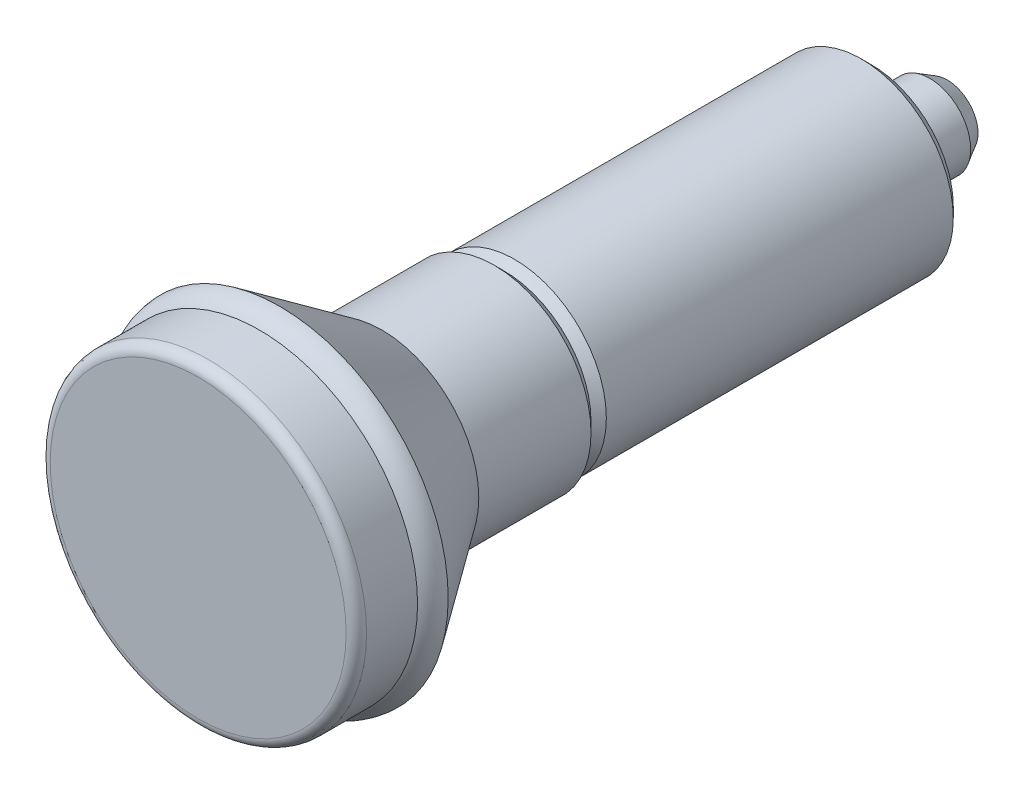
ISO-10303-21;
HEADER;
FILE_DESCRIPTION(('STEP AP214'),'2;1');
FILE_NAME('part.step','',(''),(''),'','','');
FILE_SCHEMA(('AUTOMOTIVE_DESIGN { 1 0 10303 214 1 1 1 1 }'));
ENDSEC;
DATA;
#1=APPLICATION_CONTEXT('core data for automotive mechanical design processes');
#2=APPLICATION_PROTOCOL_DEFINITION('international standard','automotive_design',2000,#1);
#3=PRODUCT_CONTEXT('',#1,'mechanical');
#4=PRODUCT('Part','Part','',(#3));
#5=PRODUCT_RELATED_PRODUCT_CATEGORY('part','',(#4));
#6=PRODUCT_DEFINITION_FORMATION('','',#4);
#7=PRODUCT_DEFINITION_CONTEXT('part definition',#1,'design');
#8=PRODUCT_DEFINITION('design','',#6,#7);
#9=PRODUCT_DEFINITION_SHAPE('','',#8);
#10=(LENGTH_UNIT() NAMED_UNIT(*) SI_UNIT(.MILLI.,.METRE.));
#11=(NAMED_UNIT(*) PLANE_ANGLE_UNIT() SI_UNIT($,.RADIAN.));
#12=(NAMED_UNIT(*) SI_UNIT($,.STERADIAN.) SOLID_ANGLE_UNIT());
#13=UNCERTAINTY_MEASURE_WITH_UNIT(LENGTH_MEASURE(1.E-05),#10,'distance_accuracy_value','');
#14=(GEOMETRIC_REPRESENTATION_CONTEXT(3) GLOBAL_UNCERTAINTY_ASSIGNED_CONTEXT((#13)) GLOBAL_UNIT_ASSIGNED_CONTEXT((#10,
#11,#12)) REPRESENTATION_CONTEXT('',''));
#15=CARTESIAN_POINT('',(0.,0.,0.));
#16=DIRECTION('',(0.,0.,1.));
#17=DIRECTION('',(1.,0.,0.));
#18=AXIS2_PLACEMENT_3D('',#15,#16,#17);
#19=CARTESIAN_POINT('',(0.,0.,1.25141216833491E-10));
#20=DIRECTION('',(0.,0.,1.));
#21=DIRECTION('',(0.,1.,0.));
#22=AXIS2_PLACEMENT_3D('',#19,#20,#21);
#23=SPHERICAL_SURFACE('',#22,8.);
#24=CARTESIAN_POINT('',(0.,0.,-7.4113534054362));
#25=DIRECTION('',(0.,0.,1.));
#26=DIRECTION('',(1.,0.,0.));
#27=AXIS2_PLACEMENT_3D('',#24,#25,#26);
#28=CIRCLE('',#27,3.01194965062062);
#29=CARTESIAN_POINT('',(3.01194965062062,0.,-7.4113534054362));
#30=VERTEX_POINT('',#29);
#31=EDGE_CURVE('E58',#30,#30,#28,.T.);
#32=ORIENTED_EDGE('',*,*,#31,.F.);
#33=EDGE_LOOP('',(#32));
#34=FACE_BOUND('',#33,.T.);
#35=ADVANCED_FACE('F12',(#34),#23,.T.);
#36=CARTESIAN_POINT('',(0.,14.5,66.));
#37=DIRECTION('',(0.,0.,1.));
#38=DIRECTION('',(1.,0.,0.));
#39=AXIS2_PLACEMENT_3D('',#36,#37,#38);
#40=PLANE('',#39);
#41=CARTESIAN_POINT('',(0.,0.,66.));
#42=DIRECTION('',(0.,0.,1.));
#43=DIRECTION('',(1.,0.,0.));
#44=AXIS2_PLACEMENT_3D('',#41,#42,#43);
#45=CIRCLE('',#44,14.5);
#46=CARTESIAN_POINT('',(14.5,0.,66.));
#47=VERTEX_POINT('',#46);
#48=EDGE_CURVE('E8',#47,#47,#45,.T.);
#49=ORIENTED_EDGE('',*,*,#48,.T.);
#50=EDGE_LOOP('',(#49));
#51=FACE_BOUND('',#50,.T.);
#52=ADVANCED_FACE('F66',(#51),#40,.T.);
#53=CARTESIAN_POINT('',(0.,0.,65.));
#54=DIRECTION('',(0.,0.,1.));
#55=DIRECTION('',(1.,0.,0.));
#56=AXIS2_PLACEMENT_3D('',#53,#54,#55);
#57=TOROIDAL_SURFACE('',#56,14.5,1.);
#58=CARTESIAN_POINT('',(0.,0.,65.));
#59=DIRECTION('',(0.,0.,1.));
#60=DIRECTION('',(1.,0.,0.));
#61=AXIS2_PLACEMENT_3D('',#58,#59,#60);
#62=CIRCLE('',#61,15.5);
#63=CARTESIAN_POINT('',(15.5,0.,65.));
#64=VERTEX_POINT('',#63);
#65=EDGE_CURVE('E18',#64,#64,#62,.T.);
#66=ORIENTED_EDGE('',*,*,#65,.T.);
#67=EDGE_LOOP('',(#66));
#68=FACE_BOUND('',#67,.T.);
#69=ORIENTED_EDGE('',*,*,#48,.F.);
#70=EDGE_LOOP('',(#69));
#71=FACE_BOUND('',#70,.T.);
#72=ADVANCED_FACE('F71',(#68,#71),#57,.T.);
#73=CARTESIAN_POINT('',(0.,0.,66.));
#74=DIRECTION('',(0.,0.,1.));
#75=DIRECTION('',(1.,0.,0.));
#76=AXIS2_PLACEMENT_3D('',#73,#74,#75);
#77=CYLINDRICAL_SURFACE('',#76,15.5);
#78=CARTESIAN_POINT('',(0.,0.,60.));
#79=DIRECTION('',(0.,0.,1.));
#80=DIRECTION('',(1.,0.,0.));
#81=AXIS2_PLACEMENT_3D('',#78,#79,#80);
#82=CIRCLE('',#81,15.5);
#83=CARTESIAN_POINT('',(15.5,0.,60.));
#84=VERTEX_POINT('',#83);
#85=EDGE_CURVE('E22',#84,#84,#82,.T.);
#86=ORIENTED_EDGE('',*,*,#85,.T.);
#87=EDGE_LOOP('',(#86));
#88=FACE_BOUND('',#87,.T.);
#89=ORIENTED_EDGE('',*,*,#65,.F.);
#90=EDGE_LOOP('',(#89));
#91=FACE_BOUND('',#90,.T.);
#92=ADVANCED_FACE('F75',(#88,#91),#77,.T.);
#93=CARTESIAN_POINT('',(0.,0.,58.));
#94=DIRECTION('',(0.,0.,1.));
#95=DIRECTION('',(1.,0.,0.));
#96=AXIS2_PLACEMENT_3D('',#93,#94,#95);
#97=TOROIDAL_SURFACE('',#96,14.0000000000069,2.49999999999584);
#98=CARTESIAN_POINT('',(0.,0.,58.));
#99=DIRECTION('',(0.,0.,1.));
#100=DIRECTION('',(1.,0.,0.));
#101=AXIS2_PLACEMENT_3D('',#98,#99,#100);
#102=CIRCLE('',#101,16.5000000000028);
#103=CARTESIAN_POINT('',(16.5000000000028,0.,58.));
#104=VERTEX_POINT('',#103);
#105=EDGE_CURVE('E26',#104,#104,#102,.T.);
#106=ORIENTED_EDGE('',*,*,#105,.T.);
#107=EDGE_LOOP('',(#106));
#108=FACE_BOUND('',#107,.T.);
#109=ORIENTED_EDGE('',*,*,#85,.F.);
#110=EDGE_LOOP('',(#109));
#111=FACE_BOUND('',#110,.T.);
#112=ADVANCED_FACE('F80',(#108,#111),#97,.T.);
#113=CARTESIAN_POINT('',(0.,0.,58.));
#114=DIRECTION('',(0.,0.,1.));
#115=DIRECTION('',(1.,0.,0.));
#116=AXIS2_PLACEMENT_3D('',#113,#114,#115);
#117=CONICAL_SURFACE('',#116,16.5000000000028,0.610725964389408);
#118=CARTESIAN_POINT('',(0.,0.,48.));
#119=DIRECTION('',(0.,0.,1.));
#120=DIRECTION('',(1.,0.,0.));
#121=AXIS2_PLACEMENT_3D('',#118,#119,#120);
#122=CIRCLE('',#121,9.5);
#123=CARTESIAN_POINT('',(9.5,0.,48.));
#124=VERTEX_POINT('',#123);
#125=EDGE_CURVE('E31',#124,#124,#122,.T.);
#126=ORIENTED_EDGE('',*,*,#125,.T.);
#127=EDGE_LOOP('',(#126));
#128=FACE_BOUND('',#127,.T.);
#129=ORIENTED_EDGE('',*,*,#105,.F.);
#130=EDGE_LOOP('',(#129));
#131=FACE_BOUND('',#130,.T.);
#132=ADVANCED_FACE('F84',(#128,#131),#117,.T.);
#133=CARTESIAN_POINT('',(0.,0.,66.));
#134=DIRECTION('',(0.,0.,1.));
#135=DIRECTION('',(1.,0.,0.));
#136=AXIS2_PLACEMENT_3D('',#133,#134,#135);
#137=CYLINDRICAL_SURFACE('',#136,9.5);
#138=CARTESIAN_POINT('',(0.,0.,37.));
#139=DIRECTION('',(0.,0.,1.));
#140=DIRECTION('',(1.,0.,0.));
#141=AXIS2_PLACEMENT_3D('',#138,#139,#140);
#142=CIRCLE('',#141,9.5);
#143=CARTESIAN_POINT('',(9.5,0.,37.));
#144=VERTEX_POINT('',#143);
#145=EDGE_CURVE('E34',#144,#144,#142,.T.);
#146=ORIENTED_EDGE('',*,*,#145,.T.);
#147=EDGE_LOOP('',(#146));
#148=FACE_BOUND('',#147,.T.);
#149=ORIENTED_EDGE('',*,*,#125,.F.);
#150=EDGE_LOOP('',(#149));
#151=FACE_BOUND('',#150,.T.);
#152=ADVANCED_FACE('F88',(#148,#151),#137,.T.);
#153=CARTESIAN_POINT('',(0.,0.,37.));
#154=DIRECTION('',(0.,0.,1.));
#155=DIRECTION('',(1.,0.,0.));
#156=AXIS2_PLACEMENT_3D('',#153,#154,#155);
#157=CONICAL_SURFACE('',#156,9.5,0.785398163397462);
#158=CARTESIAN_POINT('',(0.,0.,36.));
#159=DIRECTION('',(0.,0.,1.));
#160=DIRECTION('',(1.,0.,0.));
#161=AXIS2_PLACEMENT_3D('',#158,#159,#160);
#162=CIRCLE('',#161,8.5);
#163=CARTESIAN_POINT('',(8.5,0.,36.));
#164=VERTEX_POINT('',#163);
#165=EDGE_CURVE('E37',#164,#164,#162,.T.);
#166=ORIENTED_EDGE('',*,*,#165,.T.);
#167=EDGE_LOOP('',(#166));
#168=FACE_BOUND('',#167,.T.);
#169=ORIENTED_EDGE('',*,*,#145,.F.);
#170=EDGE_LOOP('',(#169));
#171=FACE_BOUND('',#170,.T.);
#172=ADVANCED_FACE('F92',(#168,#171),#157,.T.);
#173=CARTESIAN_POINT('',(0.,8.5,36.));
#174=DIRECTION('',(0.,0.,-1.));
#175=DIRECTION('',(-1.,0.,0.));
#176=AXIS2_PLACEMENT_3D('',#173,#174,#175);
#177=PLANE('',#176);
#178=CARTESIAN_POINT('',(0.,0.,36.));
#179=DIRECTION('',(0.,0.,1.));
#180=DIRECTION('',(1.,0.,0.));
#181=AXIS2_PLACEMENT_3D('',#178,#179,#180);
#182=CIRCLE('',#181,8.);
#183=CARTESIAN_POINT('',(8.,0.,36.));
#184=VERTEX_POINT('',#183);
#185=EDGE_CURVE('E40',#184,#184,#182,.T.);
#186=ORIENTED_EDGE('',*,*,#185,.T.);
#187=EDGE_LOOP('',(#186));
#188=FACE_BOUND('',#187,.T.);
#189=ORIENTED_EDGE('',*,*,#165,.F.);
#190=EDGE_LOOP('',(#189));
#191=FACE_BOUND('',#190,.T.);
#192=ADVANCED_FACE('F96',(#188,#191),#177,.T.);
#193=CARTESIAN_POINT('',(0.,0.,36.));
#194=DIRECTION('',(0.,0.,-1.));
#195=DIRECTION('',(-1.,0.,0.));
#196=AXIS2_PLACEMENT_3D('',#193,#194,#195);
#197=CONICAL_SURFACE('',#196,8.,0.785398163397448);
#198=CARTESIAN_POINT('',(0.,0.,35.));
#199=DIRECTION('',(0.,0.,1.));
#200=DIRECTION('',(1.,0.,0.));
#201=AXIS2_PLACEMENT_3D('',#198,#199,#200);
#202=CIRCLE('',#201,9.);
#203=CARTESIAN_POINT('',(9.,0.,35.));
#204=VERTEX_POINT('',#203);
#205=EDGE_CURVE('E43',#204,#204,#202,.T.);
#206=ORIENTED_EDGE('',*,*,#205,.T.);
#207=EDGE_LOOP('',(#206));
#208=FACE_BOUND('',#207,.T.);
#209=ORIENTED_EDGE('',*,*,#185,.F.);
#210=EDGE_LOOP('',(#209));
#211=FACE_BOUND('',#210,.T.);
#212=ADVANCED_FACE('F100',(#208,#211),#197,.T.);
#213=CARTESIAN_POINT('',(0.,0.,66.));
#214=DIRECTION('',(0.,0.,1.));
#215=DIRECTION('',(1.,0.,0.));
#216=AXIS2_PLACEMENT_3D('',#213,#214,#215);
#217=CYLINDRICAL_SURFACE('',#216,9.);
#218=CARTESIAN_POINT('',(0.,0.,1.));
#219=DIRECTION('',(0.,0.,1.));
#220=DIRECTION('',(1.,0.,0.));
#221=AXIS2_PLACEMENT_3D('',#218,#219,#220);
#222=CIRCLE('',#221,9.);
#223=CARTESIAN_POINT('',(9.,0.,1.));
#224=VERTEX_POINT('',#223);
#225=EDGE_CURVE('E46',#224,#224,#222,.T.);
#226=ORIENTED_EDGE('',*,*,#225,.T.);
#227=EDGE_LOOP('',(#226));
#228=FACE_BOUND('',#227,.T.);
#229=ORIENTED_EDGE('',*,*,#205,.F.);
#230=EDGE_LOOP('',(#229));
#231=FACE_BOUND('',#230,.T.);
#232=ADVANCED_FACE('F104',(#228,#231),#217,.T.);
#233=CARTESIAN_POINT('',(0.,0.,1.));
#234=DIRECTION('',(0.,0.,1.));
#235=DIRECTION('',(1.,0.,0.));
#236=AXIS2_PLACEMENT_3D('',#233,#234,#235);
#237=CONICAL_SURFACE('',#236,9.,0.785398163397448);
#238=CARTESIAN_POINT('',(0.,0.,0.));
#239=DIRECTION('',(0.,0.,1.));
#240=DIRECTION('',(1.,0.,0.));
#241=AXIS2_PLACEMENT_3D('',#238,#239,#240);
#242=CIRCLE('',#241,8.);
#243=CARTESIAN_POINT('',(8.,0.,0.));
#244=VERTEX_POINT('',#243);
#245=EDGE_CURVE('E49',#244,#244,#242,.T.);
#246=ORIENTED_EDGE('',*,*,#245,.T.);
#247=EDGE_LOOP('',(#246));
#248=FACE_BOUND('',#247,.T.);
#249=ORIENTED_EDGE('',*,*,#225,.F.);
#250=EDGE_LOOP('',(#249));
#251=FACE_BOUND('',#250,.T.);
#252=ADVANCED_FACE('F108',(#248,#251),#237,.T.);
#253=CARTESIAN_POINT('',(0.,4.00000000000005,0.));
#254=DIRECTION('',(0.,0.,-1.));
#255=DIRECTION('',(-1.,0.,0.));
#256=AXIS2_PLACEMENT_3D('',#253,#254,#255);
#257=PLANE('',#256);
#258=CARTESIAN_POINT('',(0.,0.,0.));
#259=DIRECTION('',(0.,0.,1.));
#260=DIRECTION('',(1.,0.,0.));
#261=AXIS2_PLACEMENT_3D('',#258,#259,#260);
#262=CIRCLE('',#261,4.00000000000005);
#263=CARTESIAN_POINT('',(4.00000000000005,0.,0.));
#264=VERTEX_POINT('',#263);
#265=EDGE_CURVE('E52',#264,#264,#262,.T.);
#266=ORIENTED_EDGE('',*,*,#265,.T.);
#267=EDGE_LOOP('',(#266));
#268=FACE_BOUND('',#267,.T.);
#269=ORIENTED_EDGE('',*,*,#245,.F.);
#270=EDGE_LOOP('',(#269));
#271=FACE_BOUND('',#270,.T.);
#272=ADVANCED_FACE('F112',(#268,#271),#257,.T.);
#273=CARTESIAN_POINT('',(0.,0.,66.));
#274=DIRECTION('',(0.,0.,1.));
#275=DIRECTION('',(1.,0.,0.));
#276=AXIS2_PLACEMENT_3D('',#273,#274,#275);
#277=CYLINDRICAL_SURFACE('',#276,4.);
#278=CARTESIAN_POINT('',(0.,0.,-5.699999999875));
#279=DIRECTION('',(0.,0.,1.));
#280=DIRECTION('',(1.,0.,0.));
#281=AXIS2_PLACEMENT_3D('',#278,#279,#280);
#282=CIRCLE('',#281,4.);
#283=CARTESIAN_POINT('',(4.,0.,-5.699999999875));
#284=VERTEX_POINT('',#283);
#285=EDGE_CURVE('E55',#284,#284,#282,.T.);
#286=ORIENTED_EDGE('',*,*,#285,.T.);
#287=EDGE_LOOP('',(#286));
#288=FACE_BOUND('',#287,.T.);
#289=ORIENTED_EDGE('',*,*,#265,.F.);
#290=EDGE_LOOP('',(#289));
#291=FACE_BOUND('',#290,.T.);
#292=ADVANCED_FACE('F116',(#288,#291),#277,.T.);
#293=CARTESIAN_POINT('',(0.,0.,-5.699999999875));
#294=DIRECTION('',(0.,0.,1.));
#295=DIRECTION('',(1.,0.,0.));
#296=AXIS2_PLACEMENT_3D('',#293,#294,#295);
#297=CONICAL_SURFACE('',#296,4.,0.523598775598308);
#298=ORIENTED_EDGE('',*,*,#31,.T.);
#299=EDGE_LOOP('',(#298));
#300=FACE_BOUND('',#299,.T.);
#301=ORIENTED_EDGE('',*,*,#285,.F.);
#302=EDGE_LOOP('',(#301));
#303=FACE_BOUND('',#302,.T.);
#304=ADVANCED_FACE('F62',(#300,#303),#297,.T.);
#305=CLOSED_SHELL('',(#35,#52,#72,#92,#112,#132,#152,#172,#192,#212,#232,#252,#272,#292,#304));
#306=MANIFOLD_SOLID_BREP('B1',#305);
#307=ADVANCED_BREP_SHAPE_REPRESENTATION('',(#18,#306),#14);
#308=SHAPE_DEFINITION_REPRESENTATION(#9,#307);
ENDSEC;
END-ISO-10303-21;
